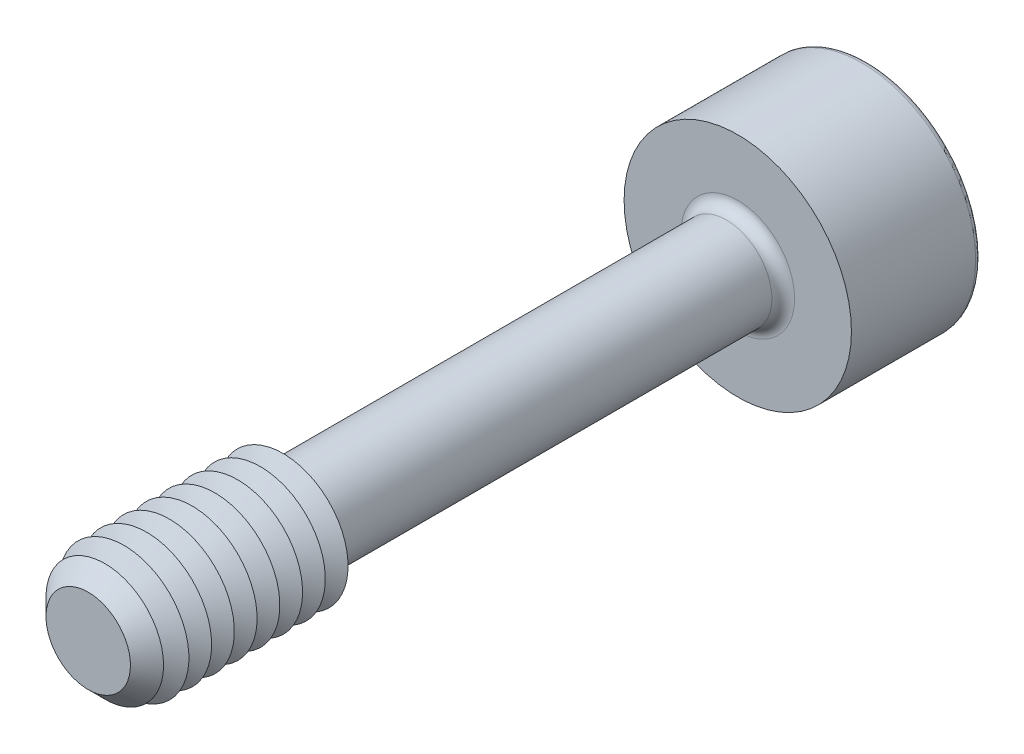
from build123d import *

# Parameters (mm, degrees)
SKETCH1_R       = 1.4
EXTRUDE1_DEPTH  = 10
CHAMFER1_SIZE   = 0.7
SKETCH3_R       = 3.5
EXTRUDE2_DEPTH  = 4
EXTRUDE3_DEPTH  = 3
FILLET1_R       = 0.35
FILLET2_R       = 0.175
LPATTERN1_COUNT = 8
LPATTERN1_PITCH = 0.7


with BuildPart() as part:
    # Sketch1 → Extrude1 (new, symmetric)
    with BuildSketch(Plane.XY):
        Circle(SKETCH1_R)
    extrude(amount=EXTRUDE1_DEPTH, both=True)

    # Sketch2 → Revolve1 (revolve)
    with BuildSketch(Plane(origin=(0, 0, 0), x_dir=(0, 0, -1), z_dir=(1, 0, 0))):
        Polygon((-10, 0), (-10, 2), (-4, 2), (-3.653589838, 1.4), (-3.653589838, 0), align=None)
    revolve(axis=Axis((0, 0, 3.653589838), (0, 0, 1)))

    # Chamfer1
    chamfer1_edges = [part.edges().sort_by_distance(p)[0] for p in [
        (0, -2, 10),
    ]]
    chamfer(chamfer1_edges, length=CHAMFER1_SIZE)

    # Sketch3 → Extrude2 (add)
    with BuildSketch(Plane(origin=(0, 0, -10), x_dir=(-1, 0, 0), z_dir=(0, 0, -1))):
        Circle(SKETCH3_R)
    extrude(amount=EXTRUDE2_DEPTH)

    # Sketch4 → Extrude3 (cut)
    with BuildSketch(Plane(origin=(-13.7, 0, -14), x_dir=(1, 0, 0), z_dir=(0, 0, 1))):
        Polygon((12.833974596, -1.5), (14.566025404, -1.5), (15.432050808, 0), (14.566025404, 1.5), (12.833974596, 1.5), (11.967949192, 0), align=None)
    extrude(amount=EXTRUDE3_DEPTH, mode=Mode.SUBTRACT)

    # Fillet1
    fillet1_edges = [part.edges().sort_by_distance(p)[0] for p in [
        (-1.4, 0, -10),
    ]]
    fillet(fillet1_edges, radius=FILLET1_R)

    # Fillet2
    fillet2_edges = [part.edges().sort_by_distance(p)[0] for p in [
        (3.5, 0, -14),
    ]]
    fillet(fillet2_edges, radius=FILLET2_R)

    # Sketch5 → Cut-Revolve1 (revolve, cut)
    with BuildSketch(Plane(origin=(0, 0, 0), x_dir=(0, 0, -1), z_dir=(1, 0, 0)), mode=Mode.PRIVATE) as cut_revolve1_sk:
        Polygon((11, 0), (11, -1.5), (10.133974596, 0), align=None)
    revolve(cut_revolve1_sk.sketch.rotate(Axis((0, 0, -10.133974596), (0, 0, -1)), 90), axis=Axis((0, 0, -10.133974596), (0, 0, -1)), mode=Mode.SUBTRACT)

    # Sketch7 → Cut-Revolve2 (revolve, cut)
    with BuildSketch(Plane(origin=(0, 0, 0), x_dir=(0, 0, -1), z_dir=(1, 0, 0)), mode=Mode.PRIVATE) as cut_revolve2_sk:
        Polygon((-4, 2), (-4.35, 1.393782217), (-4.7, 2), align=None)
    cut_revolve2 = revolve(cut_revolve2_sk.sketch.rotate(Axis((0, 0, -1.332048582), (0, 0, 1)), 90), axis=Axis((0, 0, -1.332048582), (0, 0, 1)), mode=Mode.SUBTRACT)

    # LPattern1: Cut-Revolve2 ×8
    with Locations(*[(0, 0, i * LPATTERN1_PITCH) for i in range(1, LPATTERN1_COUNT)]):
        add(cut_revolve2, mode=Mode.SUBTRACT)


solid = part.part
